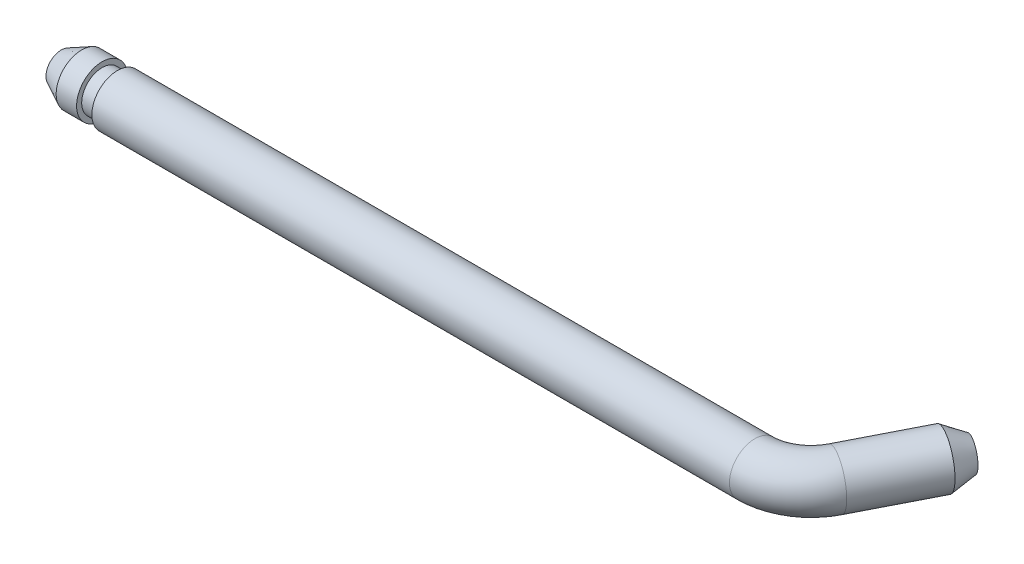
ISO-10303-21;
HEADER;
FILE_DESCRIPTION(('STEP AP214'),'2;1');
FILE_NAME('part.step','',(''),(''),'','','');
FILE_SCHEMA(('AUTOMOTIVE_DESIGN { 1 0 10303 214 1 1 1 1 }'));
ENDSEC;
DATA;
#1=APPLICATION_CONTEXT('core data for automotive mechanical design processes');
#2=APPLICATION_PROTOCOL_DEFINITION('international standard','automotive_design',2000,#1);
#3=PRODUCT_CONTEXT('',#1,'mechanical');
#4=PRODUCT('Part','Part','',(#3));
#5=PRODUCT_RELATED_PRODUCT_CATEGORY('part','',(#4));
#6=PRODUCT_DEFINITION_FORMATION('','',#4);
#7=PRODUCT_DEFINITION_CONTEXT('part definition',#1,'design');
#8=PRODUCT_DEFINITION('design','',#6,#7);
#9=PRODUCT_DEFINITION_SHAPE('','',#8);
#10=(LENGTH_UNIT() NAMED_UNIT(*) SI_UNIT(.MILLI.,.METRE.));
#11=(NAMED_UNIT(*) PLANE_ANGLE_UNIT() SI_UNIT($,.RADIAN.));
#12=(NAMED_UNIT(*) SI_UNIT($,.STERADIAN.) SOLID_ANGLE_UNIT());
#13=UNCERTAINTY_MEASURE_WITH_UNIT(LENGTH_MEASURE(1.E-05),#10,'distance_accuracy_value','');
#14=(GEOMETRIC_REPRESENTATION_CONTEXT(3) GLOBAL_UNCERTAINTY_ASSIGNED_CONTEXT((#13)) GLOBAL_UNIT_ASSIGNED_CONTEXT((#10,
#11,#12)) REPRESENTATION_CONTEXT('',''));
#15=CARTESIAN_POINT('',(0.,0.,0.));
#16=DIRECTION('',(0.,0.,1.));
#17=DIRECTION('',(1.,0.,0.));
#18=AXIS2_PLACEMENT_3D('',#15,#16,#17);
#19=CARTESIAN_POINT('',(0.,0.,0.));
#20=DIRECTION('',(1.,0.,0.));
#21=DIRECTION('',(0.,0.,-1.));
#22=AXIS2_PLACEMENT_3D('',#19,#20,#21);
#23=PLANE('',#22);
#24=CARTESIAN_POINT('',(0.,0.,-2.5));
#25=DIRECTION('',(1.,0.,0.));
#26=DIRECTION('',(0.,0.,-1.));
#27=AXIS2_PLACEMENT_3D('',#24,#25,#26);
#28=CIRCLE('',#27,1.50000000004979);
#29=CARTESIAN_POINT('',(0.,0.,-4.0000000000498));
#30=VERTEX_POINT('',#29);
#31=EDGE_CURVE('E17',#30,#30,#28,.T.);
#32=ORIENTED_EDGE('',*,*,#31,.F.);
#33=EDGE_LOOP('',(#32));
#34=FACE_BOUND('',#33,.T.);
#35=ADVANCED_FACE('F14',(#34),#23,.F.);
#36=CARTESIAN_POINT('',(1.99999999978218,0.,-2.5));
#37=DIRECTION('',(1.,0.,0.));
#38=DIRECTION('',(0.,0.,-1.));
#39=AXIS2_PLACEMENT_3D('',#36,#37,#38);
#40=CONICAL_SURFACE('',#39,2.49999999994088,0.463647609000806);
#41=CARTESIAN_POINT('',(2.,0.,-2.5));
#42=DIRECTION('',(1.,0.,0.));
#43=DIRECTION('',(0.,0.,-1.));
#44=AXIS2_PLACEMENT_3D('',#41,#42,#43);
#45=CIRCLE('',#44,2.5);
#46=CARTESIAN_POINT('',(2.,0.,-5.));
#47=VERTEX_POINT('',#46);
#48=EDGE_CURVE('E30',#47,#47,#45,.T.);
#49=ORIENTED_EDGE('',*,*,#48,.F.);
#50=EDGE_LOOP('',(#49));
#51=FACE_BOUND('',#50,.T.);
#52=ORIENTED_EDGE('',*,*,#31,.T.);
#53=EDGE_LOOP('',(#52));
#54=FACE_BOUND('',#53,.T.);
#55=ADVANCED_FACE('F51',(#51,#54),#40,.T.);
#56=CARTESIAN_POINT('',(79.61998983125,0.,-13.184));
#57=DIRECTION('',(0.453990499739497,0.,-0.891006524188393));
#58=DIRECTION('',(-0.891006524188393,0.,-0.453990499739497));
#59=AXIS2_PLACEMENT_3D('',#56,#57,#58);
#60=PLANE('',#59);
#61=CARTESIAN_POINT('',(77.3924735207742,0.,-14.318976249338));
#62=DIRECTION('',(-0.453990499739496,0.,0.891006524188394));
#63=DIRECTION('',(0.891006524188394,0.,0.453990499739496));
#64=AXIS2_PLACEMENT_3D('',#61,#62,#63);
#65=CIRCLE('',#64,1.49999999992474);
#66=CARTESIAN_POINT('',(78.7289833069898,0.,-13.637990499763));
#67=VERTEX_POINT('',#66);
#68=EDGE_CURVE('E41',#67,#67,#65,.T.);
#69=ORIENTED_EDGE('',*,*,#68,.F.);
#70=EDGE_LOOP('',(#69));
#71=FACE_BOUND('',#70,.T.);
#72=ADVANCED_FACE('F58',(#71),#60,.T.);
#73=CARTESIAN_POINT('',(0.,0.,-2.5));
#74=DIRECTION('',(1.,0.,0.));
#75=DIRECTION('',(0.,0.,-1.));
#76=AXIS2_PLACEMENT_3D('',#73,#74,#75);
#77=CYLINDRICAL_SURFACE('',#76,2.5);
#78=CARTESIAN_POINT('',(4.,0.,-2.5));
#79=DIRECTION('',(1.,0.,0.));
#80=DIRECTION('',(0.,0.,-1.));
#81=AXIS2_PLACEMENT_3D('',#78,#79,#80);
#82=CIRCLE('',#81,2.5);
#83=CARTESIAN_POINT('',(4.,0.,-5.));
#84=VERTEX_POINT('',#83);
#85=EDGE_CURVE('E39',#84,#84,#82,.F.);
#86=ORIENTED_EDGE('',*,*,#85,.T.);
#87=EDGE_LOOP('',(#86));
#88=FACE_BOUND('',#87,.T.);
#89=ORIENTED_EDGE('',*,*,#48,.T.);
#90=EDGE_LOOP('',(#89));
#91=FACE_BOUND('',#90,.T.);
#92=ADVANCED_FACE('F89',(#88,#91),#77,.T.);
#93=CARTESIAN_POINT('',(76.48449252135,0.,-12.5369632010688));
#94=DIRECTION('',(-0.453990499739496,0.,0.891006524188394));
#95=DIRECTION('',(0.891006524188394,0.,0.453990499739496));
#96=AXIS2_PLACEMENT_3D('',#93,#94,#95);
#97=CONICAL_SURFACE('',#96,2.49999999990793,0.463647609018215);
#98=CARTESIAN_POINT('',(76.4844925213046,0.,-12.5369632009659));
#99=DIRECTION('',(0.453990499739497,0.,-0.891006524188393));
#100=DIRECTION('',(-0.891006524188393,0.,-0.453990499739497));
#101=AXIS2_PLACEMENT_3D('',#98,#99,#100);
#102=CIRCLE('',#101,2.5);
#103=CARTESIAN_POINT('',(74.2569762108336,0.,-13.6719394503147));
#104=VERTEX_POINT('',#103);
#105=EDGE_CURVE('E38',#104,#104,#102,.F.);
#106=ORIENTED_EDGE('',*,*,#105,.F.);
#107=EDGE_LOOP('',(#106));
#108=FACE_BOUND('',#107,.T.);
#109=ORIENTED_EDGE('',*,*,#68,.T.);
#110=EDGE_LOOP('',(#109));
#111=FACE_BOUND('',#110,.T.);
#112=ADVANCED_FACE('F86',(#108,#111),#97,.T.);
#113=CARTESIAN_POINT('',(4.,0.,-2.5));
#114=DIRECTION('',(-1.,0.,0.));
#115=DIRECTION('',(0.,0.,1.));
#116=AXIS2_PLACEMENT_3D('',#113,#114,#115);
#117=PLANE('',#116);
#118=CARTESIAN_POINT('',(4.,0.,-2.5));
#119=DIRECTION('',(-1.,0.,0.));
#120=DIRECTION('',(0.,0.,1.));
#121=AXIS2_PLACEMENT_3D('',#118,#119,#120);
#122=CIRCLE('',#121,2.);
#123=CARTESIAN_POINT('',(4.,0.,-0.5));
#124=VERTEX_POINT('',#123);
#125=EDGE_CURVE('E35',#124,#124,#122,.F.);
#126=ORIENTED_EDGE('',*,*,#125,.F.);
#127=EDGE_LOOP('',(#126));
#128=FACE_BOUND('',#127,.T.);
#129=ORIENTED_EDGE('',*,*,#85,.F.);
#130=EDGE_LOOP('',(#129));
#131=FACE_BOUND('',#130,.T.);
#132=ADVANCED_FACE('F88',(#128,#131),#117,.F.);
#133=CARTESIAN_POINT('',(72.90053588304,0.,-5.503052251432));
#134=DIRECTION('',(0.453990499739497,0.,-0.891006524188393));
#135=DIRECTION('',(-0.891006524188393,0.,-0.453990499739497));
#136=AXIS2_PLACEMENT_3D('',#133,#134,#135);
#137=CYLINDRICAL_SURFACE('',#136,2.5);
#138=CARTESIAN_POINT('',(72.9005358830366,0.,-5.50305225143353));
#139=DIRECTION('',(0.453990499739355,0.,-0.891006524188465));
#140=DIRECTION('',(0.891006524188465,0.,0.453990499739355));
#141=AXIS2_PLACEMENT_3D('',#138,#139,#140);
#142=CIRCLE('',#141,2.5);
#143=CARTESIAN_POINT('',(75.1280521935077,0.,-4.36807600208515));
#144=VERTEX_POINT('',#143);
#145=EDGE_CURVE('E34',#144,#144,#142,.F.);
#146=ORIENTED_EDGE('',*,*,#145,.F.);
#147=EDGE_LOOP('',(#146));
#148=FACE_BOUND('',#147,.T.);
#149=ORIENTED_EDGE('',*,*,#105,.T.);
#150=EDGE_LOOP('',(#149));
#151=FACE_BOUND('',#150,.T.);
#152=ADVANCED_FACE('F84',(#148,#151),#137,.T.);
#153=CARTESIAN_POINT('',(5.775,0.,-2.5));
#154=DIRECTION('',(-1.,0.,0.));
#155=DIRECTION('',(0.,0.,1.));
#156=AXIS2_PLACEMENT_3D('',#153,#154,#155);
#157=CYLINDRICAL_SURFACE('',#156,2.);
#158=ORIENTED_EDGE('',*,*,#125,.T.);
#159=EDGE_LOOP('',(#158));
#160=FACE_BOUND('',#159,.T.);
#161=CARTESIAN_POINT('',(5.5,0.,-2.5));
#162=DIRECTION('',(-1.,0.,0.));
#163=DIRECTION('',(0.,0.,1.));
#164=AXIS2_PLACEMENT_3D('',#161,#162,#163);
#165=CIRCLE('',#164,2.);
#166=CARTESIAN_POINT('',(5.5,0.,-0.5));
#167=VERTEX_POINT('',#166);
#168=EDGE_CURVE('E26',#167,#167,#165,.F.);
#169=ORIENTED_EDGE('',*,*,#168,.F.);
#170=EDGE_LOOP('',(#169));
#171=FACE_BOUND('',#170,.T.);
#172=ADVANCED_FACE('F75',(#160,#171),#157,.T.);
#173=CARTESIAN_POINT('',(68.,0.,-8.));
#174=DIRECTION('',(0.,1.,0.));
#175=DIRECTION('',(0.,0.,-1.));
#176=AXIS2_PLACEMENT_3D('',#173,#174,#175);
#177=TOROIDAL_SURFACE('',#176,5.5,2.5);
#178=ORIENTED_EDGE('',*,*,#145,.T.);
#179=EDGE_LOOP('',(#178));
#180=FACE_BOUND('',#179,.T.);
#181=CARTESIAN_POINT('',(68.,0.,-2.5));
#182=DIRECTION('',(1.,0.,0.));
#183=DIRECTION('',(0.,0.,-1.));
#184=AXIS2_PLACEMENT_3D('',#181,#182,#183);
#185=CIRCLE('',#184,2.5);
#186=CARTESIAN_POINT('',(68.,0.,-5.));
#187=VERTEX_POINT('',#186);
#188=EDGE_CURVE('E21',#187,#187,#185,.F.);
#189=ORIENTED_EDGE('',*,*,#188,.F.);
#190=EDGE_LOOP('',(#189));
#191=FACE_BOUND('',#190,.T.);
#192=ADVANCED_FACE('F68',(#180,#191),#177,.T.);
#193=CARTESIAN_POINT('',(5.5,0.,-2.5));
#194=DIRECTION('',(-1.,0.,0.));
#195=DIRECTION('',(0.,0.,1.));
#196=AXIS2_PLACEMENT_3D('',#193,#194,#195);
#197=PLANE('',#196);
#198=ORIENTED_EDGE('',*,*,#168,.T.);
#199=EDGE_LOOP('',(#198));
#200=FACE_BOUND('',#199,.T.);
#201=CARTESIAN_POINT('',(5.5,0.,-2.5));
#202=DIRECTION('',(1.,0.,0.));
#203=DIRECTION('',(0.,0.,-1.));
#204=AXIS2_PLACEMENT_3D('',#201,#202,#203);
#205=CIRCLE('',#204,2.5);
#206=CARTESIAN_POINT('',(5.5,0.,-5.));
#207=VERTEX_POINT('',#206);
#208=EDGE_CURVE('E10',#207,#207,#205,.T.);
#209=ORIENTED_EDGE('',*,*,#208,.F.);
#210=EDGE_LOOP('',(#209));
#211=FACE_BOUND('',#210,.T.);
#212=ADVANCED_FACE('F62',(#200,#211),#197,.T.);
#213=CARTESIAN_POINT('',(0.,0.,-2.5));
#214=DIRECTION('',(1.,0.,0.));
#215=DIRECTION('',(0.,0.,-1.));
#216=AXIS2_PLACEMENT_3D('',#213,#214,#215);
#217=CYLINDRICAL_SURFACE('',#216,2.5);
#218=ORIENTED_EDGE('',*,*,#188,.T.);
#219=EDGE_LOOP('',(#218));
#220=FACE_BOUND('',#219,.T.);
#221=ORIENTED_EDGE('',*,*,#208,.T.);
#222=EDGE_LOOP('',(#221));
#223=FACE_BOUND('',#222,.T.);
#224=ADVANCED_FACE('F60',(#220,#223),#217,.T.);
#225=CLOSED_SHELL('',(#35,#55,#72,#92,#112,#132,#152,#172,#192,#212,#224));
#226=MANIFOLD_SOLID_BREP('B1',#225);
#227=ADVANCED_BREP_SHAPE_REPRESENTATION('',(#18,#226),#14);
#228=SHAPE_DEFINITION_REPRESENTATION(#9,#227);
ENDSEC;
END-ISO-10303-21;
